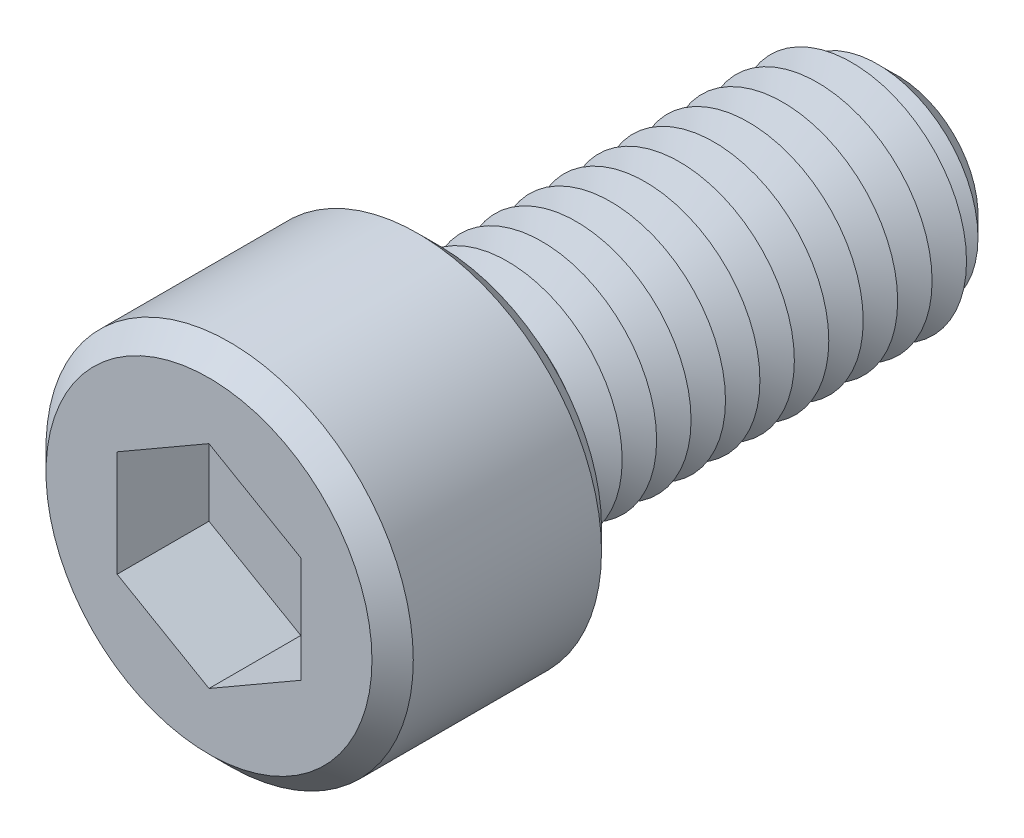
from build123d import *

# Parameters (mm, degrees)
SKETCH1_R           = 8
BOSS_EXTRUDE1_DEPTH = 10
SKETCH2_R           = 5
BOSS_EXTRUDE2_DEPTH = 20
CHAMFER1_SIZE       = 1.5
LPATTERN1_COUNT     = 13
LPATTERN1_PITCH     = 1.5
CUT_EXTRUDE1_DEPTH  = 4
SKETCH6_R           = 0.9
CUT_EXTRUDE2_DEPTH  = 26
CHAMFER2_SIZE       = 0.9


with BuildPart() as part:
    # Sketch1 → Boss-Extrude1 (new body)
    with BuildSketch(Plane.XY):
        Circle(SKETCH1_R)
    extrude(amount=BOSS_EXTRUDE1_DEPTH)

    # Sketch2 → Boss-Extrude2 (add)
    with BuildSketch(Plane(origin=(0, 0, 0), x_dir=(-1, 0, 0), z_dir=(0, 0, -1))):
        Circle(SKETCH2_R)
    extrude(amount=BOSS_EXTRUDE2_DEPTH)

    # Chamfer1
    chamfer1_edges = [part.edges().sort_by_distance(p)[0] for p in [
        (5, 0, -20),
    ]]
    chamfer(chamfer1_edges, length=CHAMFER1_SIZE)

    # Sketch4 → Cut-Revolve1 (revolve, cut)
    with BuildSketch(Plane(origin=(0, 0, 0), x_dir=(0, 0, -1), z_dir=(1, 0, 0)), mode=Mode.PRIVATE) as cut_revolve1_sk:
        Polygon((0, 5), (0.75, 3.700961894), (1.5, 5), align=None)
    cut_revolve1 = revolve(cut_revolve1_sk.sketch.rotate(Axis((0, 0, 2.512122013), (0, 0, -1)), 90), axis=Axis((0, 0, 2.512122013), (0, 0, -1)), mode=Mode.SUBTRACT)

    # LPattern1: Cut-Revolve1 ×13
    with Locations(*[(0, 0, -i * LPATTERN1_PITCH) for i in range(1, LPATTERN1_COUNT)]):
        add(cut_revolve1, mode=Mode.SUBTRACT)

    # Sketch5 → Cut-Extrude1 (cut)
    with BuildSketch(Plane.XY.offset(10)):
        Polygon((0, 4.618802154), (-4, 2.309401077), (-4, -2.309401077), (0, -4.618802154), (4, -2.309401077), (4, 2.309401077), align=None)
    extrude(amount=-CUT_EXTRUDE1_DEPTH, mode=Mode.SUBTRACT)

    # Sketch6 → Cut-Extrude2 (cut)
    with BuildSketch(Plane.XY.offset(6)):
        Circle(SKETCH6_R)
    extrude(amount=-CUT_EXTRUDE2_DEPTH, mode=Mode.SUBTRACT)

    # Chamfer2
    chamfer2_edges = [part.edges().sort_by_distance(p)[0] for p in [
        (-8, 0, 0),
        (-8, 0, 10),
    ]]
    chamfer(chamfer2_edges, length=CHAMFER2_SIZE)


solid = part.part
